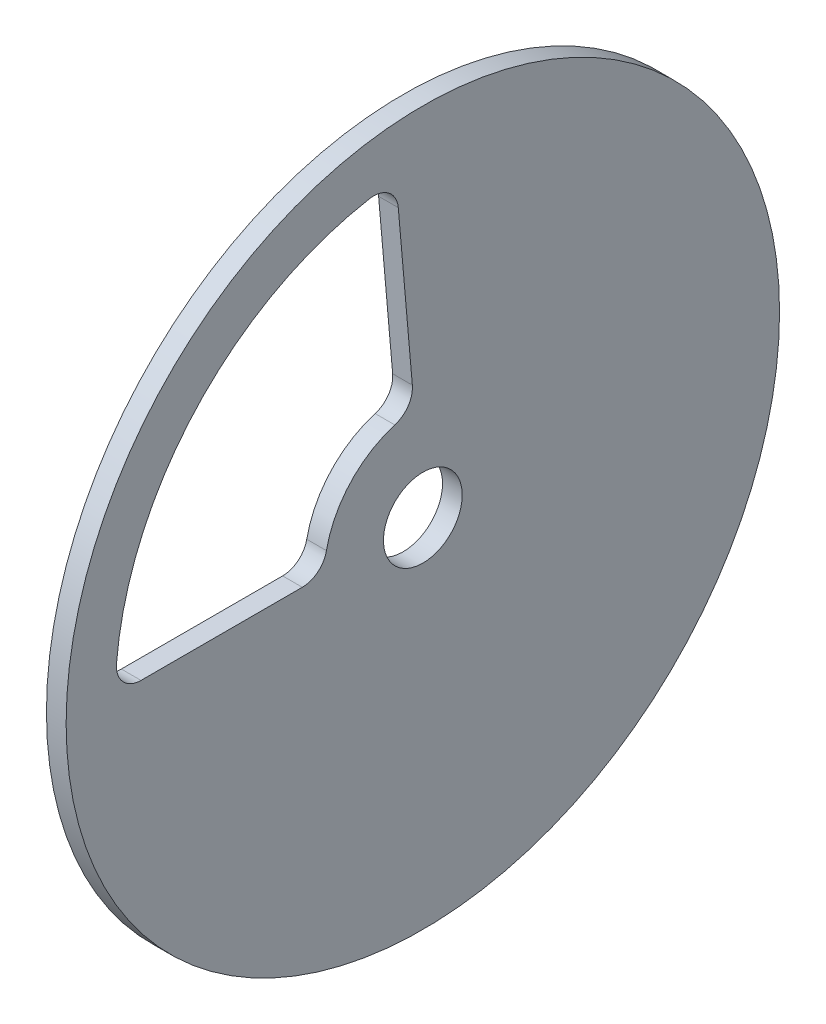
ISO-10303-21;
HEADER;
FILE_DESCRIPTION(('STEP AP214'),'2;1');
FILE_NAME('part.step','',(''),(''),'','','');
FILE_SCHEMA(('AUTOMOTIVE_DESIGN { 1 0 10303 214 1 1 1 1 }'));
ENDSEC;
DATA;
#1=APPLICATION_CONTEXT('core data for automotive mechanical design processes');
#2=APPLICATION_PROTOCOL_DEFINITION('international standard','automotive_design',2000,#1);
#3=PRODUCT_CONTEXT('',#1,'mechanical');
#4=PRODUCT('Part','Part','',(#3));
#5=PRODUCT_RELATED_PRODUCT_CATEGORY('part','',(#4));
#6=PRODUCT_DEFINITION_FORMATION('','',#4);
#7=PRODUCT_DEFINITION_CONTEXT('part definition',#1,'design');
#8=PRODUCT_DEFINITION('design','',#6,#7);
#9=PRODUCT_DEFINITION_SHAPE('','',#8);
#10=(LENGTH_UNIT() NAMED_UNIT(*) SI_UNIT(.MILLI.,.METRE.));
#11=(NAMED_UNIT(*) PLANE_ANGLE_UNIT() SI_UNIT($,.RADIAN.));
#12=(NAMED_UNIT(*) SI_UNIT($,.STERADIAN.) SOLID_ANGLE_UNIT());
#13=UNCERTAINTY_MEASURE_WITH_UNIT(LENGTH_MEASURE(1.E-05),#10,'distance_accuracy_value','');
#14=(GEOMETRIC_REPRESENTATION_CONTEXT(3) GLOBAL_UNCERTAINTY_ASSIGNED_CONTEXT((#13)) GLOBAL_UNIT_ASSIGNED_CONTEXT((#10,
#11,#12)) REPRESENTATION_CONTEXT('',''));
#15=CARTESIAN_POINT('',(0.,0.,0.));
#16=DIRECTION('',(0.,0.,1.));
#17=DIRECTION('',(1.,0.,0.));
#18=AXIS2_PLACEMENT_3D('',#15,#16,#17);
#19=CARTESIAN_POINT('',(0.8,0.,0.));
#20=DIRECTION('',(1.,0.,0.));
#21=DIRECTION('',(0.,0.,-1.));
#22=AXIS2_PLACEMENT_3D('',#19,#20,#21);
#23=PLANE('',#22);
#24=CARTESIAN_POINT('',(0.8,0.,0.));
#25=DIRECTION('',(1.,0.,0.));
#26=DIRECTION('',(0.,0.,-1.));
#27=AXIS2_PLACEMENT_3D('',#24,#25,#26);
#28=CIRCLE('',#27,1.6);
#29=CARTESIAN_POINT('',(0.8,0.,-1.6));
#30=VERTEX_POINT('',#29);
#31=EDGE_CURVE('E163',#30,#30,#28,.T.);
#32=ORIENTED_EDGE('',*,*,#31,.F.);
#33=EDGE_LOOP('',(#32));
#34=FACE_BOUND('',#33,.T.);
#35=CARTESIAN_POINT('',(0.8,0.,0.));
#36=DIRECTION('',(1.,0.,0.));
#37=DIRECTION('',(0.,0.,-1.));
#38=AXIS2_PLACEMENT_3D('',#35,#36,#37);
#39=CIRCLE('',#38,14.5);
#40=CARTESIAN_POINT('',(0.8,0.,-14.5));
#41=VERTEX_POINT('',#40);
#42=EDGE_CURVE('E11',#41,#41,#39,.T.);
#43=ORIENTED_EDGE('',*,*,#42,.T.);
#44=EDGE_LOOP('',(#43));
#45=FACE_BOUND('',#44,.T.);
#46=DIRECTION('',(0.,0.996194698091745,0.0871557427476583));
#47=VECTOR('',#46,1.);
#48=CARTESIAN_POINT('',(0.8,4.88033738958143,0.426974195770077));
#49=LINE('',#48,#47);
#50=CARTESIAN_POINT('',(0.8,4.88033738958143,0.426974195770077));
#51=VERTEX_POINT('',#50);
#52=CARTESIAN_POINT('',(0.8,11.4128440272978,0.998494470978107));
#53=VERTEX_POINT('',#52);
#54=EDGE_CURVE('E106',#51,#53,#49,.T.);
#55=ORIENTED_EDGE('',*,*,#54,.F.);
#56=CARTESIAN_POINT('',(0.8,4.79318164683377,1.42316889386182));
#57=DIRECTION('',(1.,0.,0.));
#58=DIRECTION('',(0.,0.,1.));
#59=AXIS2_PLACEMENT_3D('',#56,#57,#58);
#60=CIRCLE('',#59,1.);
#61=CARTESIAN_POINT('',(0.8,3.83454531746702,1.13853511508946));
#62=VERTEX_POINT('',#61);
#63=EDGE_CURVE('E98',#62,#51,#60,.T.);
#64=ORIENTED_EDGE('',*,*,#63,.F.);
#65=CARTESIAN_POINT('',(0.8,0.,0.));
#66=DIRECTION('',(-1.,0.,0.));
#67=DIRECTION('',(0.,0.,-1.));
#68=AXIS2_PLACEMENT_3D('',#65,#66,#67);
#69=CIRCLE('',#68,4.);
#70=CARTESIAN_POINT('',(0.8,0.799999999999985,3.91918358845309));
#71=VERTEX_POINT('',#70);
#72=EDGE_CURVE('E131',#71,#62,#69,.T.);
#73=ORIENTED_EDGE('',*,*,#72,.F.);
#74=CARTESIAN_POINT('',(0.8,0.999999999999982,4.89897948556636));
#75=DIRECTION('',(1.,0.,0.));
#76=DIRECTION('',(0.,0.,-1.));
#77=AXIS2_PLACEMENT_3D('',#74,#75,#76);
#78=CIRCLE('',#77,1.);
#79=CARTESIAN_POINT('',(0.8,0.,4.89897948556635));
#80=VERTEX_POINT('',#79);
#81=EDGE_CURVE('E129',#80,#71,#78,.T.);
#82=ORIENTED_EDGE('',*,*,#81,.F.);
#83=DIRECTION('',(0.,0.,-1.));
#84=VECTOR('',#83,1.);
#85=CARTESIAN_POINT('',(0.8,0.,4.89897948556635));
#86=LINE('',#85,#84);
#87=CARTESIAN_POINT('',(0.8,0.,11.4564392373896));
#88=VERTEX_POINT('',#87);
#89=EDGE_CURVE('E127',#88,#80,#86,.T.);
#90=ORIENTED_EDGE('',*,*,#89,.F.);
#91=CARTESIAN_POINT('',(0.8,0.999999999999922,11.4564392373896));
#92=DIRECTION('',(1.,0.,0.));
#93=DIRECTION('',(0.,0.,-1.));
#94=AXIS2_PLACEMENT_3D('',#91,#92,#93);
#95=CIRCLE('',#94,1.);
#96=CARTESIAN_POINT('',(0.8,1.08695652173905,12.4526513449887));
#97=VERTEX_POINT('',#96);
#98=EDGE_CURVE('E125',#97,#88,#95,.T.);
#99=ORIENTED_EDGE('',*,*,#98,.F.);
#100=CARTESIAN_POINT('',(0.8,0.,0.));
#101=DIRECTION('',(1.,0.,0.));
#102=DIRECTION('',(0.,0.,-1.));
#103=AXIS2_PLACEMENT_3D('',#100,#101,#102);
#104=CIRCLE('',#103,12.5);
#105=CARTESIAN_POINT('',(0.8,12.3105307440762,2.16814040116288));
#106=VERTEX_POINT('',#105);
#107=EDGE_CURVE('E121',#106,#97,#104,.T.);
#108=ORIENTED_EDGE('',*,*,#107,.F.);
#109=CARTESIAN_POINT('',(0.8,11.3256882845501,1.99468916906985));
#110=DIRECTION('',(1.,0.,0.));
#111=DIRECTION('',(0.,0.,1.));
#112=AXIS2_PLACEMENT_3D('',#109,#110,#111);
#113=CIRCLE('',#112,1.);
#114=EDGE_CURVE('E119',#53,#106,#113,.T.);
#115=ORIENTED_EDGE('',*,*,#114,.F.);
#116=EDGE_LOOP('',(#55,#64,#73,#82,#90,#99,#108,#115));
#117=FACE_BOUND('',#116,.T.);
#118=ADVANCED_FACE('F33',(#34,#45,#117),#23,.T.);
#119=CARTESIAN_POINT('',(0.,0.,0.));
#120=DIRECTION('',(1.,0.,0.));
#121=DIRECTION('',(0.,0.,-1.));
#122=AXIS2_PLACEMENT_3D('',#119,#120,#121);
#123=PLANE('',#122);
#124=CARTESIAN_POINT('',(0.,0.,0.));
#125=DIRECTION('',(1.,0.,0.));
#126=DIRECTION('',(0.,0.,-1.));
#127=AXIS2_PLACEMENT_3D('',#124,#125,#126);
#128=CIRCLE('',#127,1.6);
#129=CARTESIAN_POINT('',(0.,0.,-1.6));
#130=VERTEX_POINT('',#129);
#131=EDGE_CURVE('E114',#130,#130,#128,.T.);
#132=ORIENTED_EDGE('',*,*,#131,.T.);
#133=EDGE_LOOP('',(#132));
#134=FACE_BOUND('',#133,.T.);
#135=CARTESIAN_POINT('',(0.,0.,0.));
#136=DIRECTION('',(1.,0.,0.));
#137=DIRECTION('',(0.,0.,-1.));
#138=AXIS2_PLACEMENT_3D('',#135,#136,#137);
#139=CIRCLE('',#138,14.5);
#140=CARTESIAN_POINT('',(0.,0.,-14.5));
#141=VERTEX_POINT('',#140);
#142=EDGE_CURVE('E37',#141,#141,#139,.T.);
#143=ORIENTED_EDGE('',*,*,#142,.F.);
#144=EDGE_LOOP('',(#143));
#145=FACE_BOUND('',#144,.T.);
#146=CARTESIAN_POINT('',(0.,4.79318164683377,1.42316889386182));
#147=DIRECTION('',(1.,0.,0.));
#148=DIRECTION('',(0.,0.,1.));
#149=AXIS2_PLACEMENT_3D('',#146,#147,#148);
#150=CIRCLE('',#149,1.);
#151=CARTESIAN_POINT('',(0.,3.83454531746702,1.13853511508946));
#152=VERTEX_POINT('',#151);
#153=CARTESIAN_POINT('',(0.,4.88033738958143,0.426974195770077));
#154=VERTEX_POINT('',#153);
#155=EDGE_CURVE('E56',#152,#154,#150,.T.);
#156=ORIENTED_EDGE('',*,*,#155,.T.);
#157=DIRECTION('',(0.,0.996194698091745,0.0871557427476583));
#158=VECTOR('',#157,1.);
#159=CARTESIAN_POINT('',(0.,4.88033738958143,0.426974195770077));
#160=LINE('',#159,#158);
#161=CARTESIAN_POINT('',(0.,11.4128440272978,0.998494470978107));
#162=VERTEX_POINT('',#161);
#163=EDGE_CURVE('E113',#154,#162,#160,.T.);
#164=ORIENTED_EDGE('',*,*,#163,.T.);
#165=CARTESIAN_POINT('',(0.,11.3256882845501,1.99468916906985));
#166=DIRECTION('',(1.,0.,0.));
#167=DIRECTION('',(0.,0.,1.));
#168=AXIS2_PLACEMENT_3D('',#165,#166,#167);
#169=CIRCLE('',#168,1.);
#170=CARTESIAN_POINT('',(0.,12.3105307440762,2.16814040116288));
#171=VERTEX_POINT('',#170);
#172=EDGE_CURVE('E135',#162,#171,#169,.T.);
#173=ORIENTED_EDGE('',*,*,#172,.T.);
#174=CARTESIAN_POINT('',(0.,0.,0.));
#175=DIRECTION('',(1.,0.,0.));
#176=DIRECTION('',(0.,0.,-1.));
#177=AXIS2_PLACEMENT_3D('',#174,#175,#176);
#178=CIRCLE('',#177,12.5);
#179=CARTESIAN_POINT('',(0.,1.08695652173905,12.4526513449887));
#180=VERTEX_POINT('',#179);
#181=EDGE_CURVE('E138',#171,#180,#178,.T.);
#182=ORIENTED_EDGE('',*,*,#181,.T.);
#183=CARTESIAN_POINT('',(0.,0.999999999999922,11.4564392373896));
#184=DIRECTION('',(1.,0.,0.));
#185=DIRECTION('',(0.,0.,-1.));
#186=AXIS2_PLACEMENT_3D('',#183,#184,#185);
#187=CIRCLE('',#186,1.);
#188=CARTESIAN_POINT('',(0.,0.,11.4564392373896));
#189=VERTEX_POINT('',#188);
#190=EDGE_CURVE('E141',#180,#189,#187,.T.);
#191=ORIENTED_EDGE('',*,*,#190,.T.);
#192=DIRECTION('',(0.,0.,-1.));
#193=VECTOR('',#192,1.);
#194=CARTESIAN_POINT('',(0.,0.,4.89897948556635));
#195=LINE('',#194,#193);
#196=CARTESIAN_POINT('',(0.,0.,4.89897948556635));
#197=VERTEX_POINT('',#196);
#198=EDGE_CURVE('E144',#189,#197,#195,.T.);
#199=ORIENTED_EDGE('',*,*,#198,.T.);
#200=CARTESIAN_POINT('',(0.,0.999999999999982,4.89897948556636));
#201=DIRECTION('',(1.,0.,0.));
#202=DIRECTION('',(0.,0.,-1.));
#203=AXIS2_PLACEMENT_3D('',#200,#201,#202);
#204=CIRCLE('',#203,1.);
#205=CARTESIAN_POINT('',(0.,0.799999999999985,3.91918358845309));
#206=VERTEX_POINT('',#205);
#207=EDGE_CURVE('E147',#197,#206,#204,.T.);
#208=ORIENTED_EDGE('',*,*,#207,.T.);
#209=CARTESIAN_POINT('',(0.,0.,0.));
#210=DIRECTION('',(-1.,0.,0.));
#211=DIRECTION('',(0.,0.,-1.));
#212=AXIS2_PLACEMENT_3D('',#209,#210,#211);
#213=CIRCLE('',#212,4.);
#214=EDGE_CURVE('E107',#206,#152,#213,.T.);
#215=ORIENTED_EDGE('',*,*,#214,.T.);
#216=EDGE_LOOP('',(#156,#164,#173,#182,#191,#199,#208,#215));
#217=FACE_BOUND('',#216,.T.);
#218=ADVANCED_FACE('F169',(#134,#145,#217),#123,.F.);
#219=CARTESIAN_POINT('',(0.8,0.,0.));
#220=DIRECTION('',(-1.,0.,0.));
#221=DIRECTION('',(0.,0.,1.));
#222=AXIS2_PLACEMENT_3D('',#219,#220,#221);
#223=CYLINDRICAL_SURFACE('',#222,14.5);
#224=ORIENTED_EDGE('',*,*,#42,.F.);
#225=EDGE_LOOP('',(#224));
#226=FACE_BOUND('',#225,.T.);
#227=ORIENTED_EDGE('',*,*,#142,.T.);
#228=EDGE_LOOP('',(#227));
#229=FACE_BOUND('',#228,.T.);
#230=ADVANCED_FACE('F35',(#226,#229),#223,.T.);
#231=CARTESIAN_POINT('',(0.8,0.,0.));
#232=DIRECTION('',(-1.,0.,0.));
#233=DIRECTION('',(0.,0.,1.));
#234=AXIS2_PLACEMENT_3D('',#231,#232,#233);
#235=CYLINDRICAL_SURFACE('',#234,1.6);
#236=ORIENTED_EDGE('',*,*,#31,.T.);
#237=EDGE_LOOP('',(#236));
#238=FACE_BOUND('',#237,.T.);
#239=ORIENTED_EDGE('',*,*,#131,.F.);
#240=EDGE_LOOP('',(#239));
#241=FACE_BOUND('',#240,.T.);
#242=ADVANCED_FACE('F172',(#238,#241),#235,.F.);
#243=CARTESIAN_POINT('',(0.8,4.79318164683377,1.42316889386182));
#244=DIRECTION('',(-1.,0.,0.));
#245=DIRECTION('',(0.,0.,1.));
#246=AXIS2_PLACEMENT_3D('',#243,#244,#245);
#247=CYLINDRICAL_SURFACE('',#246,1.);
#248=ORIENTED_EDGE('',*,*,#155,.F.);
#249=DIRECTION('',(-1.,0.,0.));
#250=VECTOR('',#249,1.);
#251=CARTESIAN_POINT('',(0.8,3.83454531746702,1.13853511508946));
#252=LINE('',#251,#250);
#253=EDGE_CURVE('E102',#62,#152,#252,.T.);
#254=ORIENTED_EDGE('',*,*,#253,.F.);
#255=ORIENTED_EDGE('',*,*,#63,.T.);
#256=DIRECTION('',(-1.,0.,0.));
#257=VECTOR('',#256,1.);
#258=CARTESIAN_POINT('',(0.8,4.88033738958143,0.426974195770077));
#259=LINE('',#258,#257);
#260=EDGE_CURVE('E101',#51,#154,#259,.T.);
#261=ORIENTED_EDGE('',*,*,#260,.T.);
#262=EDGE_LOOP('',(#248,#254,#255,#261));
#263=FACE_BOUND('',#262,.T.);
#264=ADVANCED_FACE('F100',(#263),#247,.F.);
#265=CARTESIAN_POINT('',(0.8,4.88033738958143,0.426974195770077));
#266=DIRECTION('',(0.,-0.0871557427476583,0.996194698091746));
#267=DIRECTION('',(0.,-0.996194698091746,-0.0871557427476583));
#268=AXIS2_PLACEMENT_3D('',#265,#266,#267);
#269=PLANE('',#268);
#270=ORIENTED_EDGE('',*,*,#163,.F.);
#271=ORIENTED_EDGE('',*,*,#260,.F.);
#272=ORIENTED_EDGE('',*,*,#54,.T.);
#273=DIRECTION('',(-1.,0.,0.));
#274=VECTOR('',#273,1.);
#275=CARTESIAN_POINT('',(0.8,11.4128440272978,0.998494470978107));
#276=LINE('',#275,#274);
#277=EDGE_CURVE('E115',#53,#162,#276,.T.);
#278=ORIENTED_EDGE('',*,*,#277,.T.);
#279=EDGE_LOOP('',(#270,#271,#272,#278));
#280=FACE_BOUND('',#279,.T.);
#281=ADVANCED_FACE('F110',(#280),#269,.T.);
#282=CARTESIAN_POINT('',(0.8,11.3256882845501,1.99468916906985));
#283=DIRECTION('',(-1.,0.,0.));
#284=DIRECTION('',(0.,0.,1.));
#285=AXIS2_PLACEMENT_3D('',#282,#283,#284);
#286=CYLINDRICAL_SURFACE('',#285,1.);
#287=ORIENTED_EDGE('',*,*,#172,.F.);
#288=ORIENTED_EDGE('',*,*,#277,.F.);
#289=ORIENTED_EDGE('',*,*,#114,.T.);
#290=DIRECTION('',(-1.,0.,0.));
#291=VECTOR('',#290,1.);
#292=CARTESIAN_POINT('',(0.8,12.3105307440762,2.16814040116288));
#293=LINE('',#292,#291);
#294=EDGE_CURVE('E160',#106,#171,#293,.T.);
#295=ORIENTED_EDGE('',*,*,#294,.T.);
#296=EDGE_LOOP('',(#287,#288,#289,#295));
#297=FACE_BOUND('',#296,.T.);
#298=ADVANCED_FACE('F217',(#297),#286,.F.);
#299=CARTESIAN_POINT('',(0.8,0.,0.));
#300=DIRECTION('',(-1.,0.,0.));
#301=DIRECTION('',(0.,0.,1.));
#302=AXIS2_PLACEMENT_3D('',#299,#300,#301);
#303=CYLINDRICAL_SURFACE('',#302,12.5);
#304=ORIENTED_EDGE('',*,*,#181,.F.);
#305=ORIENTED_EDGE('',*,*,#294,.F.);
#306=ORIENTED_EDGE('',*,*,#107,.T.);
#307=DIRECTION('',(-1.,0.,0.));
#308=VECTOR('',#307,1.);
#309=CARTESIAN_POINT('',(0.8,1.08695652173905,12.4526513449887));
#310=LINE('',#309,#308);
#311=EDGE_CURVE('E158',#97,#180,#310,.T.);
#312=ORIENTED_EDGE('',*,*,#311,.T.);
#313=EDGE_LOOP('',(#304,#305,#306,#312));
#314=FACE_BOUND('',#313,.T.);
#315=ADVANCED_FACE('F214',(#314),#303,.F.);
#316=CARTESIAN_POINT('',(0.8,0.999999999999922,11.4564392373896));
#317=DIRECTION('',(-1.,0.,0.));
#318=DIRECTION('',(0.,0.,1.));
#319=AXIS2_PLACEMENT_3D('',#316,#317,#318);
#320=CYLINDRICAL_SURFACE('',#319,1.);
#321=ORIENTED_EDGE('',*,*,#190,.F.);
#322=ORIENTED_EDGE('',*,*,#311,.F.);
#323=ORIENTED_EDGE('',*,*,#98,.T.);
#324=DIRECTION('',(-1.,0.,0.));
#325=VECTOR('',#324,1.);
#326=CARTESIAN_POINT('',(0.8,0.,11.4564392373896));
#327=LINE('',#326,#325);
#328=EDGE_CURVE('E156',#88,#189,#327,.T.);
#329=ORIENTED_EDGE('',*,*,#328,.T.);
#330=EDGE_LOOP('',(#321,#322,#323,#329));
#331=FACE_BOUND('',#330,.T.);
#332=ADVANCED_FACE('F209',(#331),#320,.F.);
#333=CARTESIAN_POINT('',(0.8,0.,4.89897948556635));
#334=DIRECTION('',(0.,1.,0.));
#335=DIRECTION('',(0.,0.,1.));
#336=AXIS2_PLACEMENT_3D('',#333,#334,#335);
#337=PLANE('',#336);
#338=ORIENTED_EDGE('',*,*,#198,.F.);
#339=ORIENTED_EDGE('',*,*,#328,.F.);
#340=ORIENTED_EDGE('',*,*,#89,.T.);
#341=DIRECTION('',(-1.,0.,0.));
#342=VECTOR('',#341,1.);
#343=CARTESIAN_POINT('',(0.8,0.,4.89897948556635));
#344=LINE('',#343,#342);
#345=EDGE_CURVE('E154',#80,#197,#344,.T.);
#346=ORIENTED_EDGE('',*,*,#345,.T.);
#347=EDGE_LOOP('',(#338,#339,#340,#346));
#348=FACE_BOUND('',#347,.T.);
#349=ADVANCED_FACE('F205',(#348),#337,.T.);
#350=CARTESIAN_POINT('',(0.8,0.999999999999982,4.89897948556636));
#351=DIRECTION('',(-1.,0.,0.));
#352=DIRECTION('',(0.,0.,1.));
#353=AXIS2_PLACEMENT_3D('',#350,#351,#352);
#354=CYLINDRICAL_SURFACE('',#353,1.);
#355=ORIENTED_EDGE('',*,*,#207,.F.);
#356=ORIENTED_EDGE('',*,*,#345,.F.);
#357=ORIENTED_EDGE('',*,*,#81,.T.);
#358=DIRECTION('',(-1.,0.,0.));
#359=VECTOR('',#358,1.);
#360=CARTESIAN_POINT('',(0.8,0.799999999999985,3.91918358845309));
#361=LINE('',#360,#359);
#362=EDGE_CURVE('E48',#71,#206,#361,.T.);
#363=ORIENTED_EDGE('',*,*,#362,.T.);
#364=EDGE_LOOP('',(#355,#356,#357,#363));
#365=FACE_BOUND('',#364,.T.);
#366=ADVANCED_FACE('F202',(#365),#354,.F.);
#367=CARTESIAN_POINT('',(0.8,0.,0.));
#368=DIRECTION('',(-1.,0.,0.));
#369=DIRECTION('',(0.,0.,1.));
#370=AXIS2_PLACEMENT_3D('',#367,#368,#369);
#371=CYLINDRICAL_SURFACE('',#370,4.);
#372=ORIENTED_EDGE('',*,*,#214,.F.);
#373=ORIENTED_EDGE('',*,*,#362,.F.);
#374=ORIENTED_EDGE('',*,*,#72,.T.);
#375=ORIENTED_EDGE('',*,*,#253,.T.);
#376=EDGE_LOOP('',(#372,#373,#374,#375));
#377=FACE_BOUND('',#376,.T.);
#378=ADVANCED_FACE('F196',(#377),#371,.T.);
#379=CLOSED_SHELL('',(#118,#218,#230,#242,#264,#281,#298,#315,#332,#349,#366,#378));
#380=MANIFOLD_SOLID_BREP('B2',#379);
#381=ADVANCED_BREP_SHAPE_REPRESENTATION('',(#18,#380),#14);
#382=SHAPE_DEFINITION_REPRESENTATION(#9,#381);
ENDSEC;
END-ISO-10303-21;
